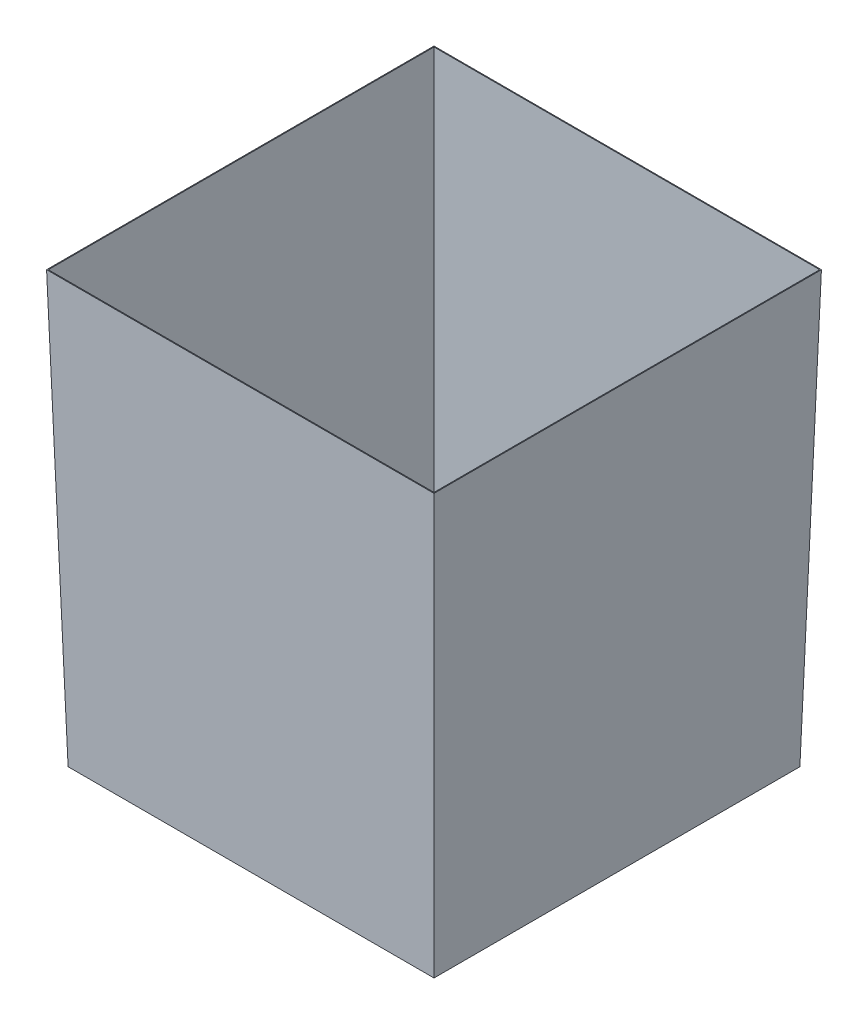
from build123d import *

# Parameters (mm, degrees)
SHELL_2_T = -2


with BuildPart() as part:
    # Sketch 1 → Loft 850-900_ H1000 section 0
    with BuildSketch(Plane(origin=(0, 0, 0), x_dir=(1, 0, 0), z_dir=(0, 1, 0))):
        with BuildLine():
            Line((-425, -425), (425, -425))
            Line((425, -425), (425, 425))
            Line((425, 425), (-425, 425))
            Line((-425, 425), (-425, -425))
        make_face()
    # Sketch 2 → Loft 850-900_ H1000 section 1
    with BuildSketch(Plane(origin=(0, 1000, 0), x_dir=(1, 0, 0), z_dir=(0, 1, 0))):
        with BuildLine():
            Line((-450, -450), (450, -450))
            Line((450, -450), (450, 450))
            Line((450, 450), (-450, 450))
            Line((-450, 450), (-450, -450))
        make_face()
    loft()

    # Shell 2
    shell_2_openings = [part.faces().sort_by_distance(p)[0] for p in [
        (0, 1000, 0),
    ]]
    offset(amount=SHELL_2_T, openings=shell_2_openings, kind=Kind.INTERSECTION)


solid = part.part
